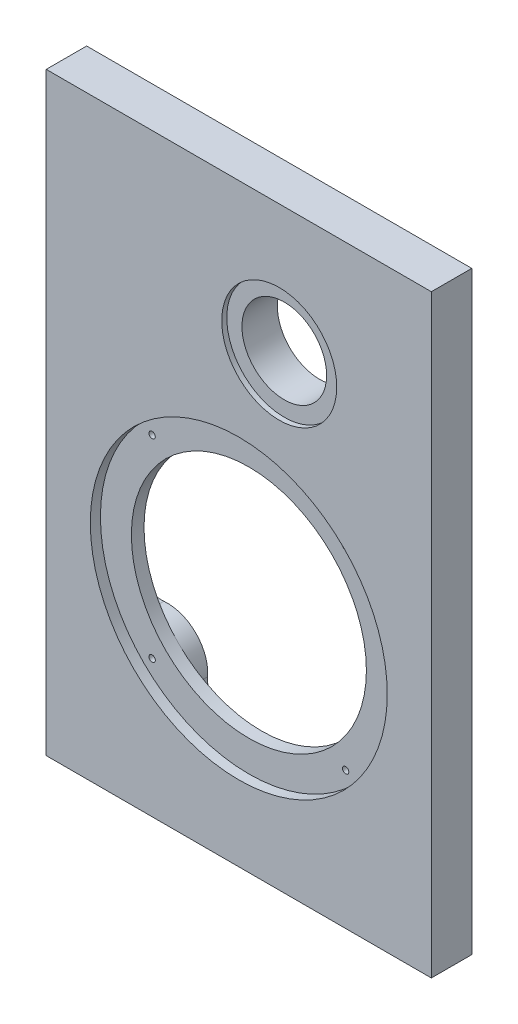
ISO-10303-21;
HEADER;
FILE_DESCRIPTION(('STEP AP214'),'2;1');
FILE_NAME('part.step','',(''),(''),'','','');
FILE_SCHEMA(('AUTOMOTIVE_DESIGN { 1 0 10303 214 1 1 1 1 }'));
ENDSEC;
DATA;
#1=APPLICATION_CONTEXT('core data for automotive mechanical design processes');
#2=APPLICATION_PROTOCOL_DEFINITION('international standard','automotive_design',2000,#1);
#3=PRODUCT_CONTEXT('',#1,'mechanical');
#4=PRODUCT('Part','Part','',(#3));
#5=PRODUCT_RELATED_PRODUCT_CATEGORY('part','',(#4));
#6=PRODUCT_DEFINITION_FORMATION('','',#4);
#7=PRODUCT_DEFINITION_CONTEXT('part definition',#1,'design');
#8=PRODUCT_DEFINITION('design','',#6,#7);
#9=PRODUCT_DEFINITION_SHAPE('','',#8);
#10=(LENGTH_UNIT() NAMED_UNIT(*) SI_UNIT(.MILLI.,.METRE.));
#11=(NAMED_UNIT(*) PLANE_ANGLE_UNIT() SI_UNIT($,.RADIAN.));
#12=(NAMED_UNIT(*) SI_UNIT($,.STERADIAN.) SOLID_ANGLE_UNIT());
#13=UNCERTAINTY_MEASURE_WITH_UNIT(LENGTH_MEASURE(1.E-05),#10,'distance_accuracy_value','');
#14=(GEOMETRIC_REPRESENTATION_CONTEXT(3) GLOBAL_UNCERTAINTY_ASSIGNED_CONTEXT((#13)) GLOBAL_UNIT_ASSIGNED_CONTEXT((#10,
#11,#12)) REPRESENTATION_CONTEXT('',''));
#15=CARTESIAN_POINT('',(0.,0.,0.));
#16=DIRECTION('',(0.,0.,1.));
#17=DIRECTION('',(1.,0.,0.));
#18=AXIS2_PLACEMENT_3D('',#15,#16,#17);
#19=CARTESIAN_POINT('',(0.,-29.05,16.));
#20=DIRECTION('',(0.,0.,-1.));
#21=DIRECTION('',(-1.,0.,0.));
#22=AXIS2_PLACEMENT_3D('',#19,#20,#21);
#23=CYLINDRICAL_SURFACE('',#22,46.5);
#24=CARTESIAN_POINT('',(0.,-29.05,7.00000000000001));
#25=DIRECTION('',(0.,0.,1.));
#26=DIRECTION('',(1.,0.,0.));
#27=AXIS2_PLACEMENT_3D('',#24,#25,#26);
#28=CIRCLE('',#27,46.5);
#29=CARTESIAN_POINT('',(46.5,-29.05,7.00000000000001));
#30=VERTEX_POINT('',#29);
#31=EDGE_CURVE('E225',#30,#30,#28,.T.);
#32=ORIENTED_EDGE('',*,*,#31,.F.);
#33=EDGE_LOOP('',(#32));
#34=FACE_BOUND('',#33,.T.);
#35=CARTESIAN_POINT('',(0.,-29.05,12.));
#36=DIRECTION('',(0.,0.,1.));
#37=DIRECTION('',(1.,0.,0.));
#38=AXIS2_PLACEMENT_3D('',#35,#36,#37);
#39=CIRCLE('',#38,46.5);
#40=CARTESIAN_POINT('',(46.5,-29.05,12.));
#41=VERTEX_POINT('',#40);
#42=EDGE_CURVE('E220',#41,#41,#39,.T.);
#43=ORIENTED_EDGE('',*,*,#42,.T.);
#44=EDGE_LOOP('',(#43));
#45=FACE_BOUND('',#44,.T.);
#46=ADVANCED_FACE('F46',(#34,#45),#23,.F.);
#47=CARTESIAN_POINT('',(16.,66.2,16.));
#48=DIRECTION('',(0.,0.,-1.));
#49=DIRECTION('',(-1.,0.,0.));
#50=AXIS2_PLACEMENT_3D('',#47,#48,#49);
#51=CYLINDRICAL_SURFACE('',#50,16.75);
#52=CARTESIAN_POINT('',(16.,66.2,0.));
#53=DIRECTION('',(0.,0.,1.));
#54=DIRECTION('',(1.,0.,0.));
#55=AXIS2_PLACEMENT_3D('',#52,#53,#54);
#56=CIRCLE('',#55,16.75);
#57=CARTESIAN_POINT('',(32.75,66.2,0.));
#58=VERTEX_POINT('',#57);
#59=EDGE_CURVE('E218',#58,#58,#56,.T.);
#60=ORIENTED_EDGE('',*,*,#59,.F.);
#61=EDGE_LOOP('',(#60));
#62=FACE_BOUND('',#61,.T.);
#63=CARTESIAN_POINT('',(16.,66.2,14.));
#64=DIRECTION('',(0.,0.,1.));
#65=DIRECTION('',(1.,0.,0.));
#66=AXIS2_PLACEMENT_3D('',#63,#64,#65);
#67=CIRCLE('',#66,16.75);
#68=CARTESIAN_POINT('',(32.75,66.2,14.));
#69=VERTEX_POINT('',#68);
#70=EDGE_CURVE('E215',#69,#69,#67,.T.);
#71=ORIENTED_EDGE('',*,*,#70,.T.);
#72=EDGE_LOOP('',(#71));
#73=FACE_BOUND('',#72,.T.);
#74=ADVANCED_FACE('F395',(#62,#73),#51,.F.);
#75=CARTESIAN_POINT('',(76.2,-117.6,16.));
#76=DIRECTION('',(0.,0.,1.));
#77=DIRECTION('',(1.,0.,0.));
#78=AXIS2_PLACEMENT_3D('',#75,#76,#77);
#79=PLANE('',#78);
#80=CARTESIAN_POINT('',(0.,-29.05,16.));
#81=DIRECTION('',(0.,0.,1.));
#82=DIRECTION('',(1.,0.,0.));
#83=AXIS2_PLACEMENT_3D('',#80,#81,#82);
#84=CIRCLE('',#83,58.75);
#85=CARTESIAN_POINT('',(58.75,-29.05,16.));
#86=VERTEX_POINT('',#85);
#87=EDGE_CURVE('E354',#86,#86,#84,.T.);
#88=ORIENTED_EDGE('',*,*,#87,.F.);
#89=EDGE_LOOP('',(#88));
#90=FACE_BOUND('',#89,.T.);
#91=CARTESIAN_POINT('',(16.,66.2,16.));
#92=DIRECTION('',(0.,0.,1.));
#93=DIRECTION('',(1.,0.,0.));
#94=AXIS2_PLACEMENT_3D('',#91,#92,#93);
#95=CIRCLE('',#94,22.75);
#96=CARTESIAN_POINT('',(38.75,66.2,16.));
#97=VERTEX_POINT('',#96);
#98=EDGE_CURVE('E223',#97,#97,#95,.T.);
#99=ORIENTED_EDGE('',*,*,#98,.F.);
#100=EDGE_LOOP('',(#99));
#101=FACE_BOUND('',#100,.T.);
#102=DIRECTION('',(0.,1.,0.));
#103=VECTOR('',#102,1.);
#104=CARTESIAN_POINT('',(76.2,117.6,16.));
#105=LINE('',#104,#103);
#106=CARTESIAN_POINT('',(76.2,-117.6,16.));
#107=VERTEX_POINT('',#106);
#108=CARTESIAN_POINT('',(76.2,117.6,16.));
#109=VERTEX_POINT('',#108);
#110=EDGE_CURVE('E193',#107,#109,#105,.T.);
#111=ORIENTED_EDGE('',*,*,#110,.T.);
#112=DIRECTION('',(-1.,0.,0.));
#113=VECTOR('',#112,1.);
#114=CARTESIAN_POINT('',(-76.2,117.6,16.));
#115=LINE('',#114,#113);
#116=CARTESIAN_POINT('',(-76.2,117.6,16.));
#117=VERTEX_POINT('',#116);
#118=EDGE_CURVE('E182',#109,#117,#115,.T.);
#119=ORIENTED_EDGE('',*,*,#118,.T.);
#120=DIRECTION('',(0.,-1.,0.));
#121=VECTOR('',#120,1.);
#122=CARTESIAN_POINT('',(-76.2,117.6,16.));
#123=LINE('',#122,#121);
#124=CARTESIAN_POINT('',(-76.2,-117.6,16.));
#125=VERTEX_POINT('',#124);
#126=EDGE_CURVE('E192',#117,#125,#123,.T.);
#127=ORIENTED_EDGE('',*,*,#126,.T.);
#128=DIRECTION('',(1.,0.,0.));
#129=VECTOR('',#128,1.);
#130=CARTESIAN_POINT('',(-76.2,-117.6,16.));
#131=LINE('',#130,#129);
#132=EDGE_CURVE('E198',#125,#107,#131,.T.);
#133=ORIENTED_EDGE('',*,*,#132,.T.);
#134=EDGE_LOOP('',(#111,#119,#127,#133));
#135=FACE_BOUND('',#134,.T.);
#136=ADVANCED_FACE('F196',(#90,#101,#135),#79,.T.);
#137=CARTESIAN_POINT('',(76.2,-117.6,0.));
#138=DIRECTION('',(0.,0.,1.));
#139=DIRECTION('',(1.,0.,0.));
#140=AXIS2_PLACEMENT_3D('',#137,#138,#139);
#141=PLANE('',#140);
#142=CARTESIAN_POINT('',(0.,-29.05,0.));
#143=DIRECTION('',(0.,0.,-1.));
#144=DIRECTION('',(-1.,0.,0.));
#145=AXIS2_PLACEMENT_3D('',#142,#143,#144);
#146=CIRCLE('',#145,60.);
#147=CARTESIAN_POINT('',(-55.7958876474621,-51.1139733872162,0.));
#148=VERTEX_POINT('',#147);
#149=CARTESIAN_POINT('',(-55.7962001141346,-6.98681680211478,0.));
#150=VERTEX_POINT('',#149);
#151=EDGE_CURVE('E298',#148,#150,#146,.T.);
#152=ORIENTED_EDGE('',*,*,#151,.F.);
#153=CARTESIAN_POINT('',(-46.4965730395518,-47.4366444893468,0.));
#154=DIRECTION('',(0.,0.,1.));
#155=DIRECTION('',(1.,0.,0.));
#156=AXIS2_PLACEMENT_3D('',#153,#154,#155);
#157=CIRCLE('',#156,10.);
#158=CARTESIAN_POINT('',(-45.6369926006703,-57.3996320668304,0.));
#159=VERTEX_POINT('',#158);
#160=EDGE_CURVE('E288',#148,#159,#157,.T.);
#161=ORIENTED_EDGE('',*,*,#160,.T.);
#162=CARTESIAN_POINT('',(-44.263947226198,-73.3139472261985,0.));
#163=DIRECTION('',(0.,0.,1.));
#164=DIRECTION('',(-1.,0.,0.));
#165=AXIS2_PLACEMENT_3D('',#162,#163,#164);
#166=CIRCLE('',#165,15.9734367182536);
#167=CARTESIAN_POINT('',(-28.3496320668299,-74.6869926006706,0.));
#168=VERTEX_POINT('',#167);
#169=EDGE_CURVE('E309',#168,#159,#166,.T.);
#170=ORIENTED_EDGE('',*,*,#169,.F.);
#171=CARTESIAN_POINT('',(-18.3866444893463,-75.546573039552,0.));
#172=DIRECTION('',(0.,0.,1.));
#173=DIRECTION('',(1.,0.,0.));
#174=AXIS2_PLACEMENT_3D('',#171,#172,#173);
#175=CIRCLE('',#174,10.);
#176=CARTESIAN_POINT('',(-22.0639733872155,-84.8458876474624,0.));
#177=VERTEX_POINT('',#176);
#178=EDGE_CURVE('E286',#168,#177,#175,.T.);
#179=ORIENTED_EDGE('',*,*,#178,.T.);
#180=CARTESIAN_POINT('',(0.,-29.05,0.));
#181=DIRECTION('',(0.,0.,-1.));
#182=DIRECTION('',(-1.,0.,0.));
#183=AXIS2_PLACEMENT_3D('',#180,#181,#182);
#184=CIRCLE('',#183,60.);
#185=CARTESIAN_POINT('',(22.0639733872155,-84.8458876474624,0.));
#186=VERTEX_POINT('',#185);
#187=EDGE_CURVE('E468',#186,#177,#184,.T.);
#188=ORIENTED_EDGE('',*,*,#187,.F.);
#189=CARTESIAN_POINT('',(18.3866444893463,-75.546573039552,0.));
#190=DIRECTION('',(0.,0.,1.));
#191=DIRECTION('',(1.,0.,0.));
#192=AXIS2_PLACEMENT_3D('',#189,#190,#191);
#193=CIRCLE('',#192,10.);
#194=CARTESIAN_POINT('',(28.3496320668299,-74.6869926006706,0.));
#195=VERTEX_POINT('',#194);
#196=EDGE_CURVE('E284',#186,#195,#193,.T.);
#197=ORIENTED_EDGE('',*,*,#196,.T.);
#198=CARTESIAN_POINT('',(44.263947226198,-73.3139472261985,0.));
#199=DIRECTION('',(0.,0.,1.));
#200=DIRECTION('',(1.,0.,0.));
#201=AXIS2_PLACEMENT_3D('',#198,#199,#200);
#202=CIRCLE('',#201,15.9734367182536);
#203=CARTESIAN_POINT('',(45.6369926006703,-57.3996320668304,0.));
#204=VERTEX_POINT('',#203);
#205=EDGE_CURVE('E467',#204,#195,#202,.T.);
#206=ORIENTED_EDGE('',*,*,#205,.F.);
#207=CARTESIAN_POINT('',(46.4965730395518,-47.4366444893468,0.));
#208=DIRECTION('',(0.,0.,1.));
#209=DIRECTION('',(1.,0.,0.));
#210=AXIS2_PLACEMENT_3D('',#207,#208,#209);
#211=CIRCLE('',#210,10.);
#212=CARTESIAN_POINT('',(55.7958876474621,-51.1139733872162,0.));
#213=VERTEX_POINT('',#212);
#214=EDGE_CURVE('E282',#204,#213,#211,.T.);
#215=ORIENTED_EDGE('',*,*,#214,.T.);
#216=CARTESIAN_POINT('',(0.,-29.05,0.));
#217=DIRECTION('',(0.,0.,-1.));
#218=DIRECTION('',(-1.,0.,0.));
#219=AXIS2_PLACEMENT_3D('',#216,#217,#218);
#220=CIRCLE('',#219,60.);
#221=CARTESIAN_POINT('',(55.7962001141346,-6.98681680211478,0.));
#222=VERTEX_POINT('',#221);
#223=EDGE_CURVE('E479',#222,#213,#220,.T.);
#224=ORIENTED_EDGE('',*,*,#223,.F.);
#225=CARTESIAN_POINT('',(46.4968334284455,-10.6640140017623,0.));
#226=DIRECTION('',(0.,0.,1.));
#227=DIRECTION('',(1.,0.,0.));
#228=AXIS2_PLACEMENT_3D('',#225,#226,#227);
#229=CIRCLE('',#228,10.);
#230=CARTESIAN_POINT('',(45.6371751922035,-0.701033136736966,0.));
#231=VERTEX_POINT('',#230);
#232=EDGE_CURVE('E54',#222,#231,#229,.T.);
#233=ORIENTED_EDGE('',*,*,#232,.T.);
#234=CARTESIAN_POINT('',(44.2639472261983,15.2139472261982,0.));
#235=DIRECTION('',(0.,0.,1.));
#236=DIRECTION('',(1.,0.,0.));
#237=AXIS2_PLACEMENT_3D('',#234,#235,#236);
#238=CIRCLE('',#237,15.9741151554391);
#239=CARTESIAN_POINT('',(28.3489668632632,16.5871751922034,0.));
#240=VERTEX_POINT('',#239);
#241=EDGE_CURVE('E477',#240,#231,#238,.T.);
#242=ORIENTED_EDGE('',*,*,#241,.F.);
#243=CARTESIAN_POINT('',(18.3859859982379,17.4468334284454,0.));
#244=DIRECTION('',(0.,0.,1.));
#245=DIRECTION('',(1.,0.,0.));
#246=AXIS2_PLACEMENT_3D('',#243,#244,#245);
#247=CIRCLE('',#246,10.);
#248=CARTESIAN_POINT('',(22.0631831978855,26.7462001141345,0.));
#249=VERTEX_POINT('',#248);
#250=EDGE_CURVE('E14',#240,#249,#247,.T.);
#251=ORIENTED_EDGE('',*,*,#250,.T.);
#252=CARTESIAN_POINT('',(0.,-29.05,0.));
#253=DIRECTION('',(0.,0.,-1.));
#254=DIRECTION('',(-1.,0.,0.));
#255=AXIS2_PLACEMENT_3D('',#252,#253,#254);
#256=CIRCLE('',#255,60.);
#257=CARTESIAN_POINT('',(-22.0631831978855,26.7462001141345,0.));
#258=VERTEX_POINT('',#257);
#259=EDGE_CURVE('E474',#258,#249,#256,.T.);
#260=ORIENTED_EDGE('',*,*,#259,.F.);
#261=CARTESIAN_POINT('',(-18.3859859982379,17.4468334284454,0.));
#262=DIRECTION('',(0.,0.,1.));
#263=DIRECTION('',(1.,0.,0.));
#264=AXIS2_PLACEMENT_3D('',#261,#262,#263);
#265=CIRCLE('',#264,10.);
#266=CARTESIAN_POINT('',(-28.3489668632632,16.5871751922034,0.));
#267=VERTEX_POINT('',#266);
#268=EDGE_CURVE('E290',#258,#267,#265,.T.);
#269=ORIENTED_EDGE('',*,*,#268,.T.);
#270=CARTESIAN_POINT('',(-44.2639472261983,15.2139472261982,0.));
#271=DIRECTION('',(0.,0.,1.));
#272=DIRECTION('',(-1.,0.,0.));
#273=AXIS2_PLACEMENT_3D('',#270,#271,#272);
#274=CIRCLE('',#273,15.9741151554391);
#275=CARTESIAN_POINT('',(-45.6371751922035,-0.701033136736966,0.));
#276=VERTEX_POINT('',#275);
#277=EDGE_CURVE('E300',#276,#267,#274,.T.);
#278=ORIENTED_EDGE('',*,*,#277,.F.);
#279=CARTESIAN_POINT('',(-46.4968334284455,-10.6640140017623,0.));
#280=DIRECTION('',(0.,0.,1.));
#281=DIRECTION('',(1.,0.,0.));
#282=AXIS2_PLACEMENT_3D('',#279,#280,#281);
#283=CIRCLE('',#282,10.);
#284=EDGE_CURVE('E292',#276,#150,#283,.T.);
#285=ORIENTED_EDGE('',*,*,#284,.T.);
#286=EDGE_LOOP('',(#152,#161,#170,#179,#188,#197,#206,#215,#224,#233,#242,#251,#260,#269,#278,#285));
#287=FACE_BOUND('',#286,.T.);
#288=DIRECTION('',(0.,1.,0.));
#289=VECTOR('',#288,1.);
#290=CARTESIAN_POINT('',(76.2,117.6,0.));
#291=LINE('',#290,#289);
#292=CARTESIAN_POINT('',(76.2,-117.6,0.));
#293=VERTEX_POINT('',#292);
#294=CARTESIAN_POINT('',(76.2,117.6,0.));
#295=VERTEX_POINT('',#294);
#296=EDGE_CURVE('E206',#293,#295,#291,.T.);
#297=ORIENTED_EDGE('',*,*,#296,.F.);
#298=DIRECTION('',(1.,0.,0.));
#299=VECTOR('',#298,1.);
#300=CARTESIAN_POINT('',(-76.2,-117.6,0.));
#301=LINE('',#300,#299);
#302=CARTESIAN_POINT('',(-76.2,-117.6,0.));
#303=VERTEX_POINT('',#302);
#304=EDGE_CURVE('E202',#303,#293,#301,.T.);
#305=ORIENTED_EDGE('',*,*,#304,.F.);
#306=DIRECTION('',(0.,-1.,0.));
#307=VECTOR('',#306,1.);
#308=CARTESIAN_POINT('',(-76.2,117.6,0.));
#309=LINE('',#308,#307);
#310=CARTESIAN_POINT('',(-76.2,117.6,0.));
#311=VERTEX_POINT('',#310);
#312=EDGE_CURVE('E373',#311,#303,#309,.T.);
#313=ORIENTED_EDGE('',*,*,#312,.F.);
#314=DIRECTION('',(-1.,0.,0.));
#315=VECTOR('',#314,1.);
#316=CARTESIAN_POINT('',(-76.2,117.6,0.));
#317=LINE('',#316,#315);
#318=EDGE_CURVE('E371',#295,#311,#317,.T.);
#319=ORIENTED_EDGE('',*,*,#318,.F.);
#320=EDGE_LOOP('',(#297,#305,#313,#319));
#321=FACE_BOUND('',#320,.T.);
#322=ORIENTED_EDGE('',*,*,#59,.T.);
#323=EDGE_LOOP('',(#322));
#324=FACE_BOUND('',#323,.T.);
#325=ADVANCED_FACE('F296',(#287,#321,#324),#141,.F.);
#326=CARTESIAN_POINT('',(76.2,117.6,16.));
#327=DIRECTION('',(-1.,0.,0.));
#328=DIRECTION('',(0.,-1.,0.));
#329=AXIS2_PLACEMENT_3D('',#326,#327,#328);
#330=PLANE('',#329);
#331=ORIENTED_EDGE('',*,*,#296,.T.);
#332=DIRECTION('',(0.,0.,-1.));
#333=VECTOR('',#332,1.);
#334=CARTESIAN_POINT('',(76.2,117.6,16.));
#335=LINE('',#334,#333);
#336=EDGE_CURVE('E186',#109,#295,#335,.T.);
#337=ORIENTED_EDGE('',*,*,#336,.F.);
#338=ORIENTED_EDGE('',*,*,#110,.F.);
#339=DIRECTION('',(0.,0.,-1.));
#340=VECTOR('',#339,1.);
#341=CARTESIAN_POINT('',(76.2,-117.6,16.));
#342=LINE('',#341,#340);
#343=EDGE_CURVE('E369',#107,#293,#342,.T.);
#344=ORIENTED_EDGE('',*,*,#343,.T.);
#345=EDGE_LOOP('',(#331,#337,#338,#344));
#346=FACE_BOUND('',#345,.T.);
#347=ADVANCED_FACE('F204',(#346),#330,.F.);
#348=CARTESIAN_POINT('',(-76.2,117.6,16.));
#349=DIRECTION('',(0.,-1.,0.));
#350=DIRECTION('',(0.,0.,-1.));
#351=AXIS2_PLACEMENT_3D('',#348,#349,#350);
#352=PLANE('',#351);
#353=ORIENTED_EDGE('',*,*,#318,.T.);
#354=DIRECTION('',(0.,0.,-1.));
#355=VECTOR('',#354,1.);
#356=CARTESIAN_POINT('',(-76.2,117.6,16.));
#357=LINE('',#356,#355);
#358=EDGE_CURVE('E189',#117,#311,#357,.T.);
#359=ORIENTED_EDGE('',*,*,#358,.F.);
#360=ORIENTED_EDGE('',*,*,#118,.F.);
#361=ORIENTED_EDGE('',*,*,#336,.T.);
#362=EDGE_LOOP('',(#353,#359,#360,#361));
#363=FACE_BOUND('',#362,.T.);
#364=ADVANCED_FACE('F184',(#363),#352,.F.);
#365=CARTESIAN_POINT('',(-76.2,117.6,16.));
#366=DIRECTION('',(1.,0.,0.));
#367=DIRECTION('',(0.,1.,0.));
#368=AXIS2_PLACEMENT_3D('',#365,#366,#367);
#369=PLANE('',#368);
#370=ORIENTED_EDGE('',*,*,#312,.T.);
#371=DIRECTION('',(0.,0.,-1.));
#372=VECTOR('',#371,1.);
#373=CARTESIAN_POINT('',(-76.2,-117.6,16.));
#374=LINE('',#373,#372);
#375=EDGE_CURVE('E211',#125,#303,#374,.T.);
#376=ORIENTED_EDGE('',*,*,#375,.F.);
#377=ORIENTED_EDGE('',*,*,#126,.F.);
#378=ORIENTED_EDGE('',*,*,#358,.T.);
#379=EDGE_LOOP('',(#370,#376,#377,#378));
#380=FACE_BOUND('',#379,.T.);
#381=ADVANCED_FACE('F384',(#380),#369,.F.);
#382=CARTESIAN_POINT('',(-76.2,-117.6,16.));
#383=DIRECTION('',(0.,1.,0.));
#384=DIRECTION('',(0.,0.,1.));
#385=AXIS2_PLACEMENT_3D('',#382,#383,#384);
#386=PLANE('',#385);
#387=ORIENTED_EDGE('',*,*,#304,.T.);
#388=ORIENTED_EDGE('',*,*,#343,.F.);
#389=ORIENTED_EDGE('',*,*,#132,.F.);
#390=ORIENTED_EDGE('',*,*,#375,.T.);
#391=EDGE_LOOP('',(#387,#388,#389,#390));
#392=FACE_BOUND('',#391,.T.);
#393=ADVANCED_FACE('F380',(#392),#386,.F.);
#394=CARTESIAN_POINT('',(16.,66.2,14.));
#395=DIRECTION('',(0.,0.,1.));
#396=DIRECTION('',(1.,0.,0.));
#397=AXIS2_PLACEMENT_3D('',#394,#395,#396);
#398=CYLINDRICAL_SURFACE('',#397,22.75);
#399=CARTESIAN_POINT('',(16.,66.2,14.));
#400=DIRECTION('',(0.,0.,1.));
#401=DIRECTION('',(1.,0.,0.));
#402=AXIS2_PLACEMENT_3D('',#399,#400,#401);
#403=CIRCLE('',#402,22.75);
#404=CARTESIAN_POINT('',(38.75,66.2,14.));
#405=VERTEX_POINT('',#404);
#406=EDGE_CURVE('E219',#405,#405,#403,.T.);
#407=ORIENTED_EDGE('',*,*,#406,.F.);
#408=EDGE_LOOP('',(#407));
#409=FACE_BOUND('',#408,.T.);
#410=ORIENTED_EDGE('',*,*,#98,.T.);
#411=EDGE_LOOP('',(#410));
#412=FACE_BOUND('',#411,.T.);
#413=ADVANCED_FACE('F391',(#409,#412),#398,.F.);
#414=CARTESIAN_POINT('',(16.,66.2,14.));
#415=DIRECTION('',(0.,0.,1.));
#416=DIRECTION('',(1.,0.,0.));
#417=AXIS2_PLACEMENT_3D('',#414,#415,#416);
#418=PLANE('',#417);
#419=ORIENTED_EDGE('',*,*,#70,.F.);
#420=EDGE_LOOP('',(#419));
#421=FACE_BOUND('',#420,.T.);
#422=ORIENTED_EDGE('',*,*,#406,.T.);
#423=EDGE_LOOP('',(#422));
#424=FACE_BOUND('',#423,.T.);
#425=ADVANCED_FACE('F552',(#421,#424),#418,.T.);
#426=CARTESIAN_POINT('',(0.,-29.05,12.));
#427=DIRECTION('',(0.,0.,1.));
#428=DIRECTION('',(1.,0.,0.));
#429=AXIS2_PLACEMENT_3D('',#426,#427,#428);
#430=CYLINDRICAL_SURFACE('',#429,58.75);
#431=CARTESIAN_POINT('',(0.,-29.05,12.));
#432=DIRECTION('',(0.,0.,1.));
#433=DIRECTION('',(1.,0.,0.));
#434=AXIS2_PLACEMENT_3D('',#431,#432,#433);
#435=CIRCLE('',#434,58.75);
#436=CARTESIAN_POINT('',(58.75,-29.05,12.));
#437=VERTEX_POINT('',#436);
#438=EDGE_CURVE('E224',#437,#437,#435,.T.);
#439=ORIENTED_EDGE('',*,*,#438,.F.);
#440=EDGE_LOOP('',(#439));
#441=FACE_BOUND('',#440,.T.);
#442=ORIENTED_EDGE('',*,*,#87,.T.);
#443=EDGE_LOOP('',(#442));
#444=FACE_BOUND('',#443,.T.);
#445=ADVANCED_FACE('F548',(#441,#444),#430,.F.);
#446=CARTESIAN_POINT('',(0.,-29.05,12.));
#447=DIRECTION('',(0.,0.,1.));
#448=DIRECTION('',(1.,0.,0.));
#449=AXIS2_PLACEMENT_3D('',#446,#447,#448);
#450=PLANE('',#449);
#451=CARTESIAN_POINT('',(38.2898322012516,9.23983220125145,12.));
#452=DIRECTION('',(0.,0.,1.));
#453=DIRECTION('',(-1.,0.,0.));
#454=AXIS2_PLACEMENT_3D('',#451,#452,#453);
#455=CIRCLE('',#454,1.25);
#456=CARTESIAN_POINT('',(37.0398322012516,9.23983220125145,12.));
#457=VERTEX_POINT('',#456);
#458=EDGE_CURVE('E227',#457,#457,#455,.T.);
#459=ORIENTED_EDGE('',*,*,#458,.F.);
#460=EDGE_LOOP('',(#459));
#461=FACE_BOUND('',#460,.T.);
#462=CARTESIAN_POINT('',(38.2898322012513,-67.3398322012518,12.));
#463=DIRECTION('',(0.,0.,1.));
#464=DIRECTION('',(-1.,0.,0.));
#465=AXIS2_PLACEMENT_3D('',#462,#463,#464);
#466=CIRCLE('',#465,1.25);
#467=CARTESIAN_POINT('',(37.0398322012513,-67.3398322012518,12.));
#468=VERTEX_POINT('',#467);
#469=EDGE_CURVE('E336',#468,#468,#466,.T.);
#470=ORIENTED_EDGE('',*,*,#469,.F.);
#471=EDGE_LOOP('',(#470));
#472=FACE_BOUND('',#471,.T.);
#473=CARTESIAN_POINT('',(-38.2898322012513,-67.3398322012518,12.));
#474=DIRECTION('',(0.,0.,1.));
#475=DIRECTION('',(1.,0.,0.));
#476=AXIS2_PLACEMENT_3D('',#473,#474,#475);
#477=CIRCLE('',#476,1.24999999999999);
#478=CARTESIAN_POINT('',(-37.0398322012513,-67.3398322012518,12.));
#479=VERTEX_POINT('',#478);
#480=EDGE_CURVE('E342',#479,#479,#477,.T.);
#481=ORIENTED_EDGE('',*,*,#480,.F.);
#482=EDGE_LOOP('',(#481));
#483=FACE_BOUND('',#482,.T.);
#484=CARTESIAN_POINT('',(-38.2898322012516,9.23983220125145,12.));
#485=DIRECTION('',(0.,0.,1.));
#486=DIRECTION('',(1.,0.,0.));
#487=AXIS2_PLACEMENT_3D('',#484,#485,#486);
#488=CIRCLE('',#487,1.25);
#489=CARTESIAN_POINT('',(-37.0398322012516,9.23983220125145,12.));
#490=VERTEX_POINT('',#489);
#491=EDGE_CURVE('E348',#490,#490,#488,.T.);
#492=ORIENTED_EDGE('',*,*,#491,.F.);
#493=EDGE_LOOP('',(#492));
#494=FACE_BOUND('',#493,.T.);
#495=ORIENTED_EDGE('',*,*,#42,.F.);
#496=EDGE_LOOP('',(#495));
#497=FACE_BOUND('',#496,.T.);
#498=ORIENTED_EDGE('',*,*,#438,.T.);
#499=EDGE_LOOP('',(#498));
#500=FACE_BOUND('',#499,.T.);
#501=ADVANCED_FACE('F544',(#461,#472,#483,#494,#497,#500),#450,.T.);
#502=CARTESIAN_POINT('',(-38.2898322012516,9.23983220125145,7.00000000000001));
#503=DIRECTION('',(0.,0.,1.));
#504=DIRECTION('',(1.,0.,0.));
#505=AXIS2_PLACEMENT_3D('',#502,#503,#504);
#506=CYLINDRICAL_SURFACE('',#505,1.25);
#507=CARTESIAN_POINT('',(-38.2898322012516,9.23983220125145,7.00000000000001));
#508=DIRECTION('',(0.,0.,1.));
#509=DIRECTION('',(1.,0.,0.));
#510=AXIS2_PLACEMENT_3D('',#507,#508,#509);
#511=CIRCLE('',#510,1.25);
#512=CARTESIAN_POINT('',(-37.0398322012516,9.23983220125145,7.00000000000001));
#513=VERTEX_POINT('',#512);
#514=EDGE_CURVE('E351',#513,#513,#511,.T.);
#515=ORIENTED_EDGE('',*,*,#514,.F.);
#516=EDGE_LOOP('',(#515));
#517=FACE_BOUND('',#516,.T.);
#518=ORIENTED_EDGE('',*,*,#491,.T.);
#519=EDGE_LOOP('',(#518));
#520=FACE_BOUND('',#519,.T.);
#521=ADVANCED_FACE('F540',(#517,#520),#506,.F.);
#522=CARTESIAN_POINT('',(-38.2898322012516,9.23983220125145,7.00000000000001));
#523=DIRECTION('',(0.,0.,1.));
#524=DIRECTION('',(1.,0.,0.));
#525=AXIS2_PLACEMENT_3D('',#522,#523,#524);
#526=PLANE('',#525);
#527=ORIENTED_EDGE('',*,*,#514,.T.);
#528=EDGE_LOOP('',(#527));
#529=FACE_BOUND('',#528,.T.);
#530=ADVANCED_FACE('F536',(#529),#526,.T.);
#531=CARTESIAN_POINT('',(-38.2898322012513,-67.3398322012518,7.00000000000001));
#532=DIRECTION('',(0.,0.,1.));
#533=DIRECTION('',(1.,0.,0.));
#534=AXIS2_PLACEMENT_3D('',#531,#532,#533);
#535=CYLINDRICAL_SURFACE('',#534,1.24999999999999);
#536=CARTESIAN_POINT('',(-38.2898322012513,-67.3398322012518,7.00000000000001));
#537=DIRECTION('',(0.,0.,1.));
#538=DIRECTION('',(1.,0.,0.));
#539=AXIS2_PLACEMENT_3D('',#536,#537,#538);
#540=CIRCLE('',#539,1.24999999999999);
#541=CARTESIAN_POINT('',(-37.0398322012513,-67.3398322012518,7.00000000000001));
#542=VERTEX_POINT('',#541);
#543=EDGE_CURVE('E345',#542,#542,#540,.T.);
#544=ORIENTED_EDGE('',*,*,#543,.F.);
#545=EDGE_LOOP('',(#544));
#546=FACE_BOUND('',#545,.T.);
#547=ORIENTED_EDGE('',*,*,#480,.T.);
#548=EDGE_LOOP('',(#547));
#549=FACE_BOUND('',#548,.T.);
#550=ADVANCED_FACE('F532',(#546,#549),#535,.F.);
#551=CARTESIAN_POINT('',(-38.2898322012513,-67.3398322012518,7.00000000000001));
#552=DIRECTION('',(0.,0.,1.));
#553=DIRECTION('',(1.,0.,0.));
#554=AXIS2_PLACEMENT_3D('',#551,#552,#553);
#555=PLANE('',#554);
#556=ORIENTED_EDGE('',*,*,#543,.T.);
#557=EDGE_LOOP('',(#556));
#558=FACE_BOUND('',#557,.T.);
#559=ADVANCED_FACE('F528',(#558),#555,.T.);
#560=CARTESIAN_POINT('',(38.2898322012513,-67.3398322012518,7.00000000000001));
#561=DIRECTION('',(0.,0.,1.));
#562=DIRECTION('',(1.,0.,0.));
#563=AXIS2_PLACEMENT_3D('',#560,#561,#562);
#564=CYLINDRICAL_SURFACE('',#563,1.25);
#565=CARTESIAN_POINT('',(38.2898322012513,-67.3398322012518,7.00000000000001));
#566=DIRECTION('',(0.,0.,1.));
#567=DIRECTION('',(-1.,0.,0.));
#568=AXIS2_PLACEMENT_3D('',#565,#566,#567);
#569=CIRCLE('',#568,1.25);
#570=CARTESIAN_POINT('',(37.0398322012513,-67.3398322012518,7.00000000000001));
#571=VERTEX_POINT('',#570);
#572=EDGE_CURVE('E339',#571,#571,#569,.T.);
#573=ORIENTED_EDGE('',*,*,#572,.F.);
#574=EDGE_LOOP('',(#573));
#575=FACE_BOUND('',#574,.T.);
#576=ORIENTED_EDGE('',*,*,#469,.T.);
#577=EDGE_LOOP('',(#576));
#578=FACE_BOUND('',#577,.T.);
#579=ADVANCED_FACE('F524',(#575,#578),#564,.F.);
#580=CARTESIAN_POINT('',(38.2898322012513,-67.3398322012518,7.00000000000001));
#581=DIRECTION('',(0.,0.,-1.));
#582=DIRECTION('',(-1.,0.,0.));
#583=AXIS2_PLACEMENT_3D('',#580,#581,#582);
#584=PLANE('',#583);
#585=ORIENTED_EDGE('',*,*,#572,.T.);
#586=EDGE_LOOP('',(#585));
#587=FACE_BOUND('',#586,.T.);
#588=ADVANCED_FACE('F520',(#587),#584,.F.);
#589=CARTESIAN_POINT('',(38.2898322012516,9.23983220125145,7.00000000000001));
#590=DIRECTION('',(0.,0.,1.));
#591=DIRECTION('',(1.,0.,0.));
#592=AXIS2_PLACEMENT_3D('',#589,#590,#591);
#593=CYLINDRICAL_SURFACE('',#592,1.25);
#594=CARTESIAN_POINT('',(38.2898322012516,9.23983220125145,7.00000000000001));
#595=DIRECTION('',(0.,0.,1.));
#596=DIRECTION('',(-1.,0.,0.));
#597=AXIS2_PLACEMENT_3D('',#594,#595,#596);
#598=CIRCLE('',#597,1.25);
#599=CARTESIAN_POINT('',(37.0398322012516,9.23983220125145,7.00000000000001));
#600=VERTEX_POINT('',#599);
#601=EDGE_CURVE('E333',#600,#600,#598,.T.);
#602=ORIENTED_EDGE('',*,*,#601,.F.);
#603=EDGE_LOOP('',(#602));
#604=FACE_BOUND('',#603,.T.);
#605=ORIENTED_EDGE('',*,*,#458,.T.);
#606=EDGE_LOOP('',(#605));
#607=FACE_BOUND('',#606,.T.);
#608=ADVANCED_FACE('F516',(#604,#607),#593,.F.);
#609=CARTESIAN_POINT('',(38.2898322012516,9.23983220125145,7.00000000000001));
#610=DIRECTION('',(0.,0.,-1.));
#611=DIRECTION('',(-1.,0.,0.));
#612=AXIS2_PLACEMENT_3D('',#609,#610,#611);
#613=PLANE('',#612);
#614=ORIENTED_EDGE('',*,*,#601,.T.);
#615=EDGE_LOOP('',(#614));
#616=FACE_BOUND('',#615,.T.);
#617=ADVANCED_FACE('F509',(#616),#613,.F.);
#618=CARTESIAN_POINT('',(0.,-29.05,7.00000000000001));
#619=DIRECTION('',(0.,0.,1.));
#620=DIRECTION('',(1.,0.,0.));
#621=AXIS2_PLACEMENT_3D('',#618,#619,#620);
#622=PLANE('',#621);
#623=ORIENTED_EDGE('',*,*,#31,.T.);
#624=EDGE_LOOP('',(#623));
#625=FACE_BOUND('',#624,.T.);
#626=CARTESIAN_POINT('',(0.,-29.05,7.00000000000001));
#627=DIRECTION('',(0.,0.,1.));
#628=DIRECTION('',(1.,0.,0.));
#629=AXIS2_PLACEMENT_3D('',#626,#627,#628);
#630=CIRCLE('',#629,60.);
#631=CARTESIAN_POINT('',(55.7962001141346,-6.98681680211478,7.00000000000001));
#632=VERTEX_POINT('',#631);
#633=CARTESIAN_POINT('',(55.7958876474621,-51.1139733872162,7.00000000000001));
#634=VERTEX_POINT('',#633);
#635=EDGE_CURVE('E451',#632,#634,#630,.F.);
#636=ORIENTED_EDGE('',*,*,#635,.T.);
#637=CARTESIAN_POINT('',(46.4965730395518,-47.4366444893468,7.00000000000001));
#638=DIRECTION('',(0.,0.,1.));
#639=DIRECTION('',(1.,0.,0.));
#640=AXIS2_PLACEMENT_3D('',#637,#638,#639);
#641=CIRCLE('',#640,10.);
#642=CARTESIAN_POINT('',(45.6369926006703,-57.3996320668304,7.00000000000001));
#643=VERTEX_POINT('',#642);
#644=EDGE_CURVE('E251',#634,#643,#641,.F.);
#645=ORIENTED_EDGE('',*,*,#644,.T.);
#646=CARTESIAN_POINT('',(44.263947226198,-73.3139472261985,7.00000000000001));
#647=DIRECTION('',(0.,0.,1.));
#648=DIRECTION('',(1.,0.,0.));
#649=AXIS2_PLACEMENT_3D('',#646,#647,#648);
#650=CIRCLE('',#649,15.9734367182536);
#651=CARTESIAN_POINT('',(28.3496320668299,-74.6869926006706,7.00000000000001));
#652=VERTEX_POINT('',#651);
#653=EDGE_CURVE('E458',#643,#652,#650,.T.);
#654=ORIENTED_EDGE('',*,*,#653,.T.);
#655=CARTESIAN_POINT('',(18.3866444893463,-75.546573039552,7.00000000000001));
#656=DIRECTION('',(0.,0.,1.));
#657=DIRECTION('',(1.,0.,0.));
#658=AXIS2_PLACEMENT_3D('',#655,#656,#657);
#659=CIRCLE('',#658,10.);
#660=CARTESIAN_POINT('',(22.0639733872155,-84.8458876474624,7.00000000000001));
#661=VERTEX_POINT('',#660);
#662=EDGE_CURVE('E249',#652,#661,#659,.F.);
#663=ORIENTED_EDGE('',*,*,#662,.T.);
#664=CARTESIAN_POINT('',(0.,-29.05,7.00000000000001));
#665=DIRECTION('',(0.,0.,1.));
#666=DIRECTION('',(1.,0.,0.));
#667=AXIS2_PLACEMENT_3D('',#664,#665,#666);
#668=CIRCLE('',#667,60.);
#669=CARTESIAN_POINT('',(-22.0639733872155,-84.8458876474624,7.00000000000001));
#670=VERTEX_POINT('',#669);
#671=EDGE_CURVE('E228',#661,#670,#668,.F.);
#672=ORIENTED_EDGE('',*,*,#671,.T.);
#673=CARTESIAN_POINT('',(-18.3866444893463,-75.546573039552,7.00000000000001));
#674=DIRECTION('',(0.,0.,1.));
#675=DIRECTION('',(1.,0.,0.));
#676=AXIS2_PLACEMENT_3D('',#673,#674,#675);
#677=CIRCLE('',#676,10.);
#678=CARTESIAN_POINT('',(-28.3496320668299,-74.6869926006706,7.00000000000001));
#679=VERTEX_POINT('',#678);
#680=EDGE_CURVE('E247',#670,#679,#677,.F.);
#681=ORIENTED_EDGE('',*,*,#680,.T.);
#682=CARTESIAN_POINT('',(-44.263947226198,-73.3139472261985,7.00000000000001));
#683=DIRECTION('',(0.,0.,1.));
#684=DIRECTION('',(1.,0.,0.));
#685=AXIS2_PLACEMENT_3D('',#682,#683,#684);
#686=CIRCLE('',#685,15.9734367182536);
#687=CARTESIAN_POINT('',(-45.6369926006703,-57.3996320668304,7.00000000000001));
#688=VERTEX_POINT('',#687);
#689=EDGE_CURVE('E329',#679,#688,#686,.T.);
#690=ORIENTED_EDGE('',*,*,#689,.T.);
#691=CARTESIAN_POINT('',(-46.4965730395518,-47.4366444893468,7.00000000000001));
#692=DIRECTION('',(0.,0.,1.));
#693=DIRECTION('',(1.,0.,0.));
#694=AXIS2_PLACEMENT_3D('',#691,#692,#693);
#695=CIRCLE('',#694,10.);
#696=CARTESIAN_POINT('',(-55.7958876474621,-51.1139733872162,7.00000000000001));
#697=VERTEX_POINT('',#696);
#698=EDGE_CURVE('E245',#688,#697,#695,.F.);
#699=ORIENTED_EDGE('',*,*,#698,.T.);
#700=CARTESIAN_POINT('',(0.,-29.05,7.00000000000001));
#701=DIRECTION('',(0.,0.,1.));
#702=DIRECTION('',(1.,0.,0.));
#703=AXIS2_PLACEMENT_3D('',#700,#701,#702);
#704=CIRCLE('',#703,60.);
#705=CARTESIAN_POINT('',(-55.7962001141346,-6.98681680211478,7.00000000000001));
#706=VERTEX_POINT('',#705);
#707=EDGE_CURVE('E320',#697,#706,#704,.F.);
#708=ORIENTED_EDGE('',*,*,#707,.T.);
#709=CARTESIAN_POINT('',(-46.4968334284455,-10.6640140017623,7.00000000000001));
#710=DIRECTION('',(0.,0.,1.));
#711=DIRECTION('',(1.,0.,0.));
#712=AXIS2_PLACEMENT_3D('',#709,#710,#711);
#713=CIRCLE('',#712,10.);
#714=CARTESIAN_POINT('',(-45.6371751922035,-0.701033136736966,7.00000000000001));
#715=VERTEX_POINT('',#714);
#716=EDGE_CURVE('E241',#706,#715,#713,.F.);
#717=ORIENTED_EDGE('',*,*,#716,.T.);
#718=CARTESIAN_POINT('',(-44.2639472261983,15.2139472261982,7.00000000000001));
#719=DIRECTION('',(0.,0.,1.));
#720=DIRECTION('',(1.,0.,0.));
#721=AXIS2_PLACEMENT_3D('',#718,#719,#720);
#722=CIRCLE('',#721,15.9741151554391);
#723=CARTESIAN_POINT('',(-28.3489668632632,16.5871751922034,7.00000000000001));
#724=VERTEX_POINT('',#723);
#725=EDGE_CURVE('E318',#715,#724,#722,.T.);
#726=ORIENTED_EDGE('',*,*,#725,.T.);
#727=CARTESIAN_POINT('',(-18.3859859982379,17.4468334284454,7.00000000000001));
#728=DIRECTION('',(0.,0.,1.));
#729=DIRECTION('',(1.,0.,0.));
#730=AXIS2_PLACEMENT_3D('',#727,#728,#729);
#731=CIRCLE('',#730,10.);
#732=CARTESIAN_POINT('',(-22.0631831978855,26.7462001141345,7.00000000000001));
#733=VERTEX_POINT('',#732);
#734=EDGE_CURVE('E243',#724,#733,#731,.F.);
#735=ORIENTED_EDGE('',*,*,#734,.T.);
#736=CARTESIAN_POINT('',(0.,-29.05,7.00000000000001));
#737=DIRECTION('',(0.,0.,1.));
#738=DIRECTION('',(1.,0.,0.));
#739=AXIS2_PLACEMENT_3D('',#736,#737,#738);
#740=CIRCLE('',#739,60.);
#741=CARTESIAN_POINT('',(22.0631831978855,26.7462001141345,7.00000000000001));
#742=VERTEX_POINT('',#741);
#743=EDGE_CURVE('E324',#733,#742,#740,.F.);
#744=ORIENTED_EDGE('',*,*,#743,.T.);
#745=CARTESIAN_POINT('',(18.3859859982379,17.4468334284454,7.00000000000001));
#746=DIRECTION('',(0.,0.,1.));
#747=DIRECTION('',(1.,0.,0.));
#748=AXIS2_PLACEMENT_3D('',#745,#746,#747);
#749=CIRCLE('',#748,10.);
#750=CARTESIAN_POINT('',(28.3489668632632,16.5871751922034,7.00000000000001));
#751=VERTEX_POINT('',#750);
#752=EDGE_CURVE('E237',#742,#751,#749,.F.);
#753=ORIENTED_EDGE('',*,*,#752,.T.);
#754=CARTESIAN_POINT('',(44.2639472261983,15.2139472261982,7.00000000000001));
#755=DIRECTION('',(0.,0.,1.));
#756=DIRECTION('',(1.,0.,0.));
#757=AXIS2_PLACEMENT_3D('',#754,#755,#756);
#758=CIRCLE('',#757,15.9741151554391);
#759=CARTESIAN_POINT('',(45.6371751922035,-0.701033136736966,7.00000000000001));
#760=VERTEX_POINT('',#759);
#761=EDGE_CURVE('E327',#751,#760,#758,.T.);
#762=ORIENTED_EDGE('',*,*,#761,.T.);
#763=CARTESIAN_POINT('',(46.4968334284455,-10.6640140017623,7.00000000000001));
#764=DIRECTION('',(0.,0.,1.));
#765=DIRECTION('',(1.,0.,0.));
#766=AXIS2_PLACEMENT_3D('',#763,#764,#765);
#767=CIRCLE('',#766,10.);
#768=EDGE_CURVE('E239',#760,#632,#767,.F.);
#769=ORIENTED_EDGE('',*,*,#768,.T.);
#770=EDGE_LOOP('',(#636,#645,#654,#663,#672,#681,#690,#699,#708,#717,#726,#735,#744,#753,#762,#769));
#771=FACE_BOUND('',#770,.T.);
#772=ADVANCED_FACE('F317',(#625,#771),#622,.F.);
#773=CARTESIAN_POINT('',(-44.263947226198,-73.3139472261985,181.705627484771));
#774=DIRECTION('',(0.,0.,-1.));
#775=DIRECTION('',(-1.,0.,0.));
#776=AXIS2_PLACEMENT_3D('',#773,#774,#775);
#777=CYLINDRICAL_SURFACE('',#776,15.9734367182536);
#778=ORIENTED_EDGE('',*,*,#689,.F.);
#779=DIRECTION('',(0.,0.,-1.));
#780=VECTOR('',#779,1.);
#781=CARTESIAN_POINT('',(-28.3496320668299,-74.6869926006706,181.705627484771));
#782=LINE('',#781,#780);
#783=EDGE_CURVE('E260',#679,#168,#782,.T.);
#784=ORIENTED_EDGE('',*,*,#783,.T.);
#785=ORIENTED_EDGE('',*,*,#169,.T.);
#786=DIRECTION('',(0.,0.,-1.));
#787=VECTOR('',#786,1.);
#788=CARTESIAN_POINT('',(-45.6369926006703,-57.3996320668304,181.705627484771));
#789=LINE('',#788,#787);
#790=EDGE_CURVE('E258',#159,#688,#789,.F.);
#791=ORIENTED_EDGE('',*,*,#790,.T.);
#792=EDGE_LOOP('',(#778,#784,#785,#791));
#793=FACE_BOUND('',#792,.T.);
#794=ADVANCED_FACE('F499',(#793),#777,.T.);
#795=CARTESIAN_POINT('',(0.,-29.05,181.705627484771));
#796=DIRECTION('',(0.,0.,-1.));
#797=DIRECTION('',(-1.,0.,0.));
#798=AXIS2_PLACEMENT_3D('',#795,#796,#797);
#799=CYLINDRICAL_SURFACE('',#798,60.);
#800=ORIENTED_EDGE('',*,*,#707,.F.);
#801=DIRECTION('',(0.,0.,-1.));
#802=VECTOR('',#801,1.);
#803=CARTESIAN_POINT('',(-55.7958876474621,-51.1139733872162,181.705627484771));
#804=LINE('',#803,#802);
#805=EDGE_CURVE('E265',#697,#148,#804,.T.);
#806=ORIENTED_EDGE('',*,*,#805,.T.);
#807=ORIENTED_EDGE('',*,*,#151,.T.);
#808=DIRECTION('',(0.,0.,-1.));
#809=VECTOR('',#808,1.);
#810=CARTESIAN_POINT('',(-55.7962001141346,-6.98681680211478,181.705627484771));
#811=LINE('',#810,#809);
#812=EDGE_CURVE('E263',#150,#706,#811,.F.);
#813=ORIENTED_EDGE('',*,*,#812,.T.);
#814=EDGE_LOOP('',(#800,#806,#807,#813));
#815=FACE_BOUND('',#814,.T.);
#816=ADVANCED_FACE('F306',(#815),#799,.F.);
#817=CARTESIAN_POINT('',(-44.2639472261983,15.2139472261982,181.705627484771));
#818=DIRECTION('',(0.,0.,-1.));
#819=DIRECTION('',(-1.,0.,0.));
#820=AXIS2_PLACEMENT_3D('',#817,#818,#819);
#821=CYLINDRICAL_SURFACE('',#820,15.9741151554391);
#822=ORIENTED_EDGE('',*,*,#277,.T.);
#823=DIRECTION('',(0.,0.,-1.));
#824=VECTOR('',#823,1.);
#825=CARTESIAN_POINT('',(-28.3489668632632,16.5871751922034,181.705627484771));
#826=LINE('',#825,#824);
#827=EDGE_CURVE('E276',#267,#724,#826,.F.);
#828=ORIENTED_EDGE('',*,*,#827,.T.);
#829=ORIENTED_EDGE('',*,*,#725,.F.);
#830=DIRECTION('',(0.,0.,-1.));
#831=VECTOR('',#830,1.);
#832=CARTESIAN_POINT('',(-45.6371751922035,-0.701033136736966,181.705627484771));
#833=LINE('',#832,#831);
#834=EDGE_CURVE('E273',#715,#276,#833,.T.);
#835=ORIENTED_EDGE('',*,*,#834,.T.);
#836=EDGE_LOOP('',(#822,#828,#829,#835));
#837=FACE_BOUND('',#836,.T.);
#838=ADVANCED_FACE('F322',(#837),#821,.T.);
#839=CARTESIAN_POINT('',(0.,-29.05,181.705627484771));
#840=DIRECTION('',(0.,0.,-1.));
#841=DIRECTION('',(-1.,0.,0.));
#842=AXIS2_PLACEMENT_3D('',#839,#840,#841);
#843=CYLINDRICAL_SURFACE('',#842,60.);
#844=ORIENTED_EDGE('',*,*,#743,.F.);
#845=DIRECTION('',(0.,0.,-1.));
#846=VECTOR('',#845,1.);
#847=CARTESIAN_POINT('',(-22.0631831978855,26.7462001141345,181.705627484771));
#848=LINE('',#847,#846);
#849=EDGE_CURVE('E270',#733,#258,#848,.T.);
#850=ORIENTED_EDGE('',*,*,#849,.T.);
#851=ORIENTED_EDGE('',*,*,#259,.T.);
#852=DIRECTION('',(0.,0.,-1.));
#853=VECTOR('',#852,1.);
#854=CARTESIAN_POINT('',(22.0631831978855,26.7462001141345,181.705627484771));
#855=LINE('',#854,#853);
#856=EDGE_CURVE('E268',#249,#742,#855,.F.);
#857=ORIENTED_EDGE('',*,*,#856,.T.);
#858=EDGE_LOOP('',(#844,#850,#851,#857));
#859=FACE_BOUND('',#858,.T.);
#860=ADVANCED_FACE('F629',(#859),#843,.F.);
#861=CARTESIAN_POINT('',(44.2639472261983,15.2139472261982,181.705627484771));
#862=DIRECTION('',(0.,0.,-1.));
#863=DIRECTION('',(-1.,0.,0.));
#864=AXIS2_PLACEMENT_3D('',#861,#862,#863);
#865=CYLINDRICAL_SURFACE('',#864,15.9741151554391);
#866=ORIENTED_EDGE('',*,*,#241,.T.);
#867=DIRECTION('',(0.,0.,-1.));
#868=VECTOR('',#867,1.);
#869=CARTESIAN_POINT('',(45.6371751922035,-0.701033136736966,181.705627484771));
#870=LINE('',#869,#868);
#871=EDGE_CURVE('E280',#231,#760,#870,.F.);
#872=ORIENTED_EDGE('',*,*,#871,.T.);
#873=ORIENTED_EDGE('',*,*,#761,.F.);
#874=DIRECTION('',(0.,0.,-1.));
#875=VECTOR('',#874,1.);
#876=CARTESIAN_POINT('',(28.3489668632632,16.5871751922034,181.705627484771));
#877=LINE('',#876,#875);
#878=EDGE_CURVE('E278',#751,#240,#877,.T.);
#879=ORIENTED_EDGE('',*,*,#878,.T.);
#880=EDGE_LOOP('',(#866,#872,#873,#879));
#881=FACE_BOUND('',#880,.T.);
#882=ADVANCED_FACE('F635',(#881),#865,.T.);
#883=CARTESIAN_POINT('',(0.,-29.05,181.705627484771));
#884=DIRECTION('',(0.,0.,-1.));
#885=DIRECTION('',(-1.,0.,0.));
#886=AXIS2_PLACEMENT_3D('',#883,#884,#885);
#887=CYLINDRICAL_SURFACE('',#886,60.);
#888=ORIENTED_EDGE('',*,*,#223,.T.);
#889=DIRECTION('',(0.,0.,-1.));
#890=VECTOR('',#889,1.);
#891=CARTESIAN_POINT('',(55.7958876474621,-51.1139733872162,181.705627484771));
#892=LINE('',#891,#890);
#893=EDGE_CURVE('E235',#213,#634,#892,.F.);
#894=ORIENTED_EDGE('',*,*,#893,.T.);
#895=ORIENTED_EDGE('',*,*,#635,.F.);
#896=DIRECTION('',(0.,0.,-1.));
#897=VECTOR('',#896,1.);
#898=CARTESIAN_POINT('',(55.7962001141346,-6.98681680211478,181.705627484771));
#899=LINE('',#898,#897);
#900=EDGE_CURVE('E232',#632,#222,#899,.T.);
#901=ORIENTED_EDGE('',*,*,#900,.T.);
#902=EDGE_LOOP('',(#888,#894,#895,#901));
#903=FACE_BOUND('',#902,.T.);
#904=ADVANCED_FACE('F456',(#903),#887,.F.);
#905=CARTESIAN_POINT('',(44.263947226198,-73.3139472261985,181.705627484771));
#906=DIRECTION('',(0.,0.,-1.));
#907=DIRECTION('',(-1.,0.,0.));
#908=AXIS2_PLACEMENT_3D('',#905,#906,#907);
#909=CYLINDRICAL_SURFACE('',#908,15.9734367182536);
#910=ORIENTED_EDGE('',*,*,#653,.F.);
#911=DIRECTION('',(0.,0.,-1.));
#912=VECTOR('',#911,1.);
#913=CARTESIAN_POINT('',(45.6369926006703,-57.3996320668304,181.705627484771));
#914=LINE('',#913,#912);
#915=EDGE_CURVE('E209',#643,#204,#914,.T.);
#916=ORIENTED_EDGE('',*,*,#915,.T.);
#917=ORIENTED_EDGE('',*,*,#205,.T.);
#918=DIRECTION('',(0.,0.,-1.));
#919=VECTOR('',#918,1.);
#920=CARTESIAN_POINT('',(28.3496320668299,-74.6869926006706,181.705627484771));
#921=LINE('',#920,#919);
#922=EDGE_CURVE('E207',#195,#652,#921,.F.);
#923=ORIENTED_EDGE('',*,*,#922,.T.);
#924=EDGE_LOOP('',(#910,#916,#917,#923));
#925=FACE_BOUND('',#924,.T.);
#926=ADVANCED_FACE('F486',(#925),#909,.T.);
#927=CARTESIAN_POINT('',(0.,-29.05,181.705627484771));
#928=DIRECTION('',(0.,0.,-1.));
#929=DIRECTION('',(-1.,0.,0.));
#930=AXIS2_PLACEMENT_3D('',#927,#928,#929);
#931=CYLINDRICAL_SURFACE('',#930,60.);
#932=ORIENTED_EDGE('',*,*,#671,.F.);
#933=DIRECTION('',(0.,0.,-1.));
#934=VECTOR('',#933,1.);
#935=CARTESIAN_POINT('',(22.0639733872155,-84.8458876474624,181.705627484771));
#936=LINE('',#935,#934);
#937=EDGE_CURVE('E255',#661,#186,#936,.T.);
#938=ORIENTED_EDGE('',*,*,#937,.T.);
#939=ORIENTED_EDGE('',*,*,#187,.T.);
#940=DIRECTION('',(0.,0.,-1.));
#941=VECTOR('',#940,1.);
#942=CARTESIAN_POINT('',(-22.0639733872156,-84.8458876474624,181.705627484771));
#943=LINE('',#942,#941);
#944=EDGE_CURVE('E253',#177,#670,#943,.F.);
#945=ORIENTED_EDGE('',*,*,#944,.T.);
#946=EDGE_LOOP('',(#932,#938,#939,#945));
#947=FACE_BOUND('',#946,.T.);
#948=ADVANCED_FACE('F422',(#947),#931,.F.);
#949=CARTESIAN_POINT('',(46.4965730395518,-47.4366444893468,181.705627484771));
#950=DIRECTION('',(0.,0.,-1.));
#951=DIRECTION('',(-1.,0.,0.));
#952=AXIS2_PLACEMENT_3D('',#949,#950,#951);
#953=CYLINDRICAL_SURFACE('',#952,10.);
#954=ORIENTED_EDGE('',*,*,#644,.F.);
#955=ORIENTED_EDGE('',*,*,#893,.F.);
#956=ORIENTED_EDGE('',*,*,#214,.F.);
#957=ORIENTED_EDGE('',*,*,#915,.F.);
#958=EDGE_LOOP('',(#954,#955,#956,#957));
#959=FACE_BOUND('',#958,.T.);
#960=ADVANCED_FACE('F418',(#959),#953,.F.);
#961=CARTESIAN_POINT('',(18.3866444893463,-75.546573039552,181.705627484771));
#962=DIRECTION('',(0.,0.,-1.));
#963=DIRECTION('',(-1.,0.,0.));
#964=AXIS2_PLACEMENT_3D('',#961,#962,#963);
#965=CYLINDRICAL_SURFACE('',#964,10.);
#966=ORIENTED_EDGE('',*,*,#662,.F.);
#967=ORIENTED_EDGE('',*,*,#922,.F.);
#968=ORIENTED_EDGE('',*,*,#196,.F.);
#969=ORIENTED_EDGE('',*,*,#937,.F.);
#970=EDGE_LOOP('',(#966,#967,#968,#969));
#971=FACE_BOUND('',#970,.T.);
#972=ADVANCED_FACE('F421',(#971),#965,.F.);
#973=CARTESIAN_POINT('',(-18.3866444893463,-75.546573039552,181.705627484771));
#974=DIRECTION('',(0.,0.,-1.));
#975=DIRECTION('',(-1.,0.,0.));
#976=AXIS2_PLACEMENT_3D('',#973,#974,#975);
#977=CYLINDRICAL_SURFACE('',#976,10.);
#978=ORIENTED_EDGE('',*,*,#680,.F.);
#979=ORIENTED_EDGE('',*,*,#944,.F.);
#980=ORIENTED_EDGE('',*,*,#178,.F.);
#981=ORIENTED_EDGE('',*,*,#783,.F.);
#982=EDGE_LOOP('',(#978,#979,#980,#981));
#983=FACE_BOUND('',#982,.T.);
#984=ADVANCED_FACE('F426',(#983),#977,.F.);
#985=CARTESIAN_POINT('',(-46.4965730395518,-47.4366444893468,181.705627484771));
#986=DIRECTION('',(0.,0.,-1.));
#987=DIRECTION('',(-1.,0.,0.));
#988=AXIS2_PLACEMENT_3D('',#985,#986,#987);
#989=CYLINDRICAL_SURFACE('',#988,10.);
#990=ORIENTED_EDGE('',*,*,#698,.F.);
#991=ORIENTED_EDGE('',*,*,#790,.F.);
#992=ORIENTED_EDGE('',*,*,#160,.F.);
#993=ORIENTED_EDGE('',*,*,#805,.F.);
#994=EDGE_LOOP('',(#990,#991,#992,#993));
#995=FACE_BOUND('',#994,.T.);
#996=ADVANCED_FACE('F430',(#995),#989,.F.);
#997=CARTESIAN_POINT('',(-18.3859859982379,17.4468334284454,181.705627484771));
#998=DIRECTION('',(0.,0.,-1.));
#999=DIRECTION('',(-1.,0.,0.));
#1000=AXIS2_PLACEMENT_3D('',#997,#998,#999);
#1001=CYLINDRICAL_SURFACE('',#1000,10.);
#1002=ORIENTED_EDGE('',*,*,#734,.F.);
#1003=ORIENTED_EDGE('',*,*,#827,.F.);
#1004=ORIENTED_EDGE('',*,*,#268,.F.);
#1005=ORIENTED_EDGE('',*,*,#849,.F.);
#1006=EDGE_LOOP('',(#1002,#1003,#1004,#1005));
#1007=FACE_BOUND('',#1006,.T.);
#1008=ADVANCED_FACE('F434',(#1007),#1001,.F.);
#1009=CARTESIAN_POINT('',(-46.4968334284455,-10.6640140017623,181.705627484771));
#1010=DIRECTION('',(0.,0.,-1.));
#1011=DIRECTION('',(-1.,0.,0.));
#1012=AXIS2_PLACEMENT_3D('',#1009,#1010,#1011);
#1013=CYLINDRICAL_SURFACE('',#1012,10.);
#1014=ORIENTED_EDGE('',*,*,#716,.F.);
#1015=ORIENTED_EDGE('',*,*,#812,.F.);
#1016=ORIENTED_EDGE('',*,*,#284,.F.);
#1017=ORIENTED_EDGE('',*,*,#834,.F.);
#1018=EDGE_LOOP('',(#1014,#1015,#1016,#1017));
#1019=FACE_BOUND('',#1018,.T.);
#1020=ADVANCED_FACE('F312',(#1019),#1013,.F.);
#1021=CARTESIAN_POINT('',(46.4968334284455,-10.6640140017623,181.705627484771));
#1022=DIRECTION('',(0.,0.,-1.));
#1023=DIRECTION('',(-1.,0.,0.));
#1024=AXIS2_PLACEMENT_3D('',#1021,#1022,#1023);
#1025=CYLINDRICAL_SURFACE('',#1024,10.);
#1026=ORIENTED_EDGE('',*,*,#768,.F.);
#1027=ORIENTED_EDGE('',*,*,#871,.F.);
#1028=ORIENTED_EDGE('',*,*,#232,.F.);
#1029=ORIENTED_EDGE('',*,*,#900,.F.);
#1030=EDGE_LOOP('',(#1026,#1027,#1028,#1029));
#1031=FACE_BOUND('',#1030,.T.);
#1032=ADVANCED_FACE('F440',(#1031),#1025,.F.);
#1033=CARTESIAN_POINT('',(18.3859859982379,17.4468334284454,181.705627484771));
#1034=DIRECTION('',(0.,0.,-1.));
#1035=DIRECTION('',(-1.,0.,0.));
#1036=AXIS2_PLACEMENT_3D('',#1033,#1034,#1035);
#1037=CYLINDRICAL_SURFACE('',#1036,10.);
#1038=ORIENTED_EDGE('',*,*,#752,.F.);
#1039=ORIENTED_EDGE('',*,*,#856,.F.);
#1040=ORIENTED_EDGE('',*,*,#250,.F.);
#1041=ORIENTED_EDGE('',*,*,#878,.F.);
#1042=EDGE_LOOP('',(#1038,#1039,#1040,#1041));
#1043=FACE_BOUND('',#1042,.T.);
#1044=ADVANCED_FACE('F48',(#1043),#1037,.F.);
#1045=CLOSED_SHELL('',(#46,#74,#136,#325,#347,#364,#381,#393,#413,#425,#445,#501,#521,#530,#550,
#559,#579,#588,#608,#617,#772,#794,#816,#838,#860,#882,#904,#926,#948,#960,#972,#984,#996,#1008,
#1020,#1032,#1044));
#1046=MANIFOLD_SOLID_BREP('B2',#1045);
#1047=ADVANCED_BREP_SHAPE_REPRESENTATION('',(#18,#1046),#14);
#1048=SHAPE_DEFINITION_REPRESENTATION(#9,#1047);
ENDSEC;
END-ISO-10303-21;
